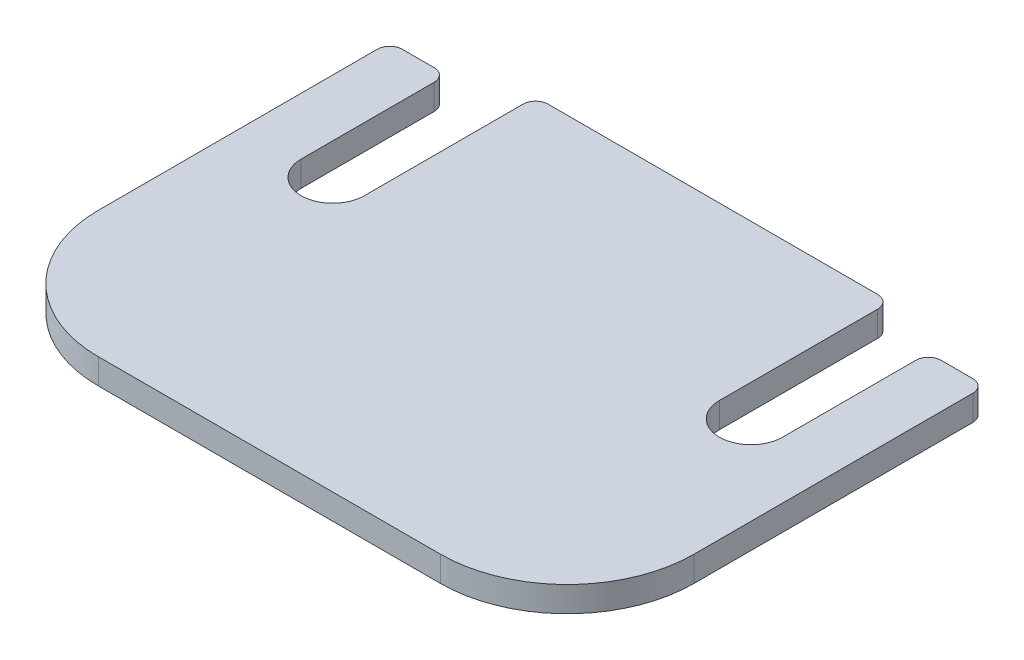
ISO-10303-21;
HEADER;
FILE_DESCRIPTION(('STEP AP214'),'2;1');
FILE_NAME('part.step','',(''),(''),'','','');
FILE_SCHEMA(('AUTOMOTIVE_DESIGN { 1 0 10303 214 1 1 1 1 }'));
ENDSEC;
DATA;
#1=APPLICATION_CONTEXT('core data for automotive mechanical design processes');
#2=APPLICATION_PROTOCOL_DEFINITION('international standard','automotive_design',2000,#1);
#3=PRODUCT_CONTEXT('',#1,'mechanical');
#4=PRODUCT('Part','Part','',(#3));
#5=PRODUCT_RELATED_PRODUCT_CATEGORY('part','',(#4));
#6=PRODUCT_DEFINITION_FORMATION('','',#4);
#7=PRODUCT_DEFINITION_CONTEXT('part definition',#1,'design');
#8=PRODUCT_DEFINITION('design','',#6,#7);
#9=PRODUCT_DEFINITION_SHAPE('','',#8);
#10=(LENGTH_UNIT() NAMED_UNIT(*) SI_UNIT(.MILLI.,.METRE.));
#11=(NAMED_UNIT(*) PLANE_ANGLE_UNIT() SI_UNIT($,.RADIAN.));
#12=(NAMED_UNIT(*) SI_UNIT($,.STERADIAN.) SOLID_ANGLE_UNIT());
#13=UNCERTAINTY_MEASURE_WITH_UNIT(LENGTH_MEASURE(1.E-05),#10,'distance_accuracy_value','');
#14=(GEOMETRIC_REPRESENTATION_CONTEXT(3) GLOBAL_UNCERTAINTY_ASSIGNED_CONTEXT((#13)) GLOBAL_UNIT_ASSIGNED_CONTEXT((#10,
#11,#12)) REPRESENTATION_CONTEXT('',''));
#15=CARTESIAN_POINT('',(0.,0.,0.));
#16=DIRECTION('',(0.,0.,1.));
#17=DIRECTION('',(1.,0.,0.));
#18=AXIS2_PLACEMENT_3D('',#15,#16,#17);
#19=CARTESIAN_POINT('',(13.5,2.,7.50000000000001));
#20=DIRECTION('',(0.,-1.,0.));
#21=DIRECTION('',(0.,0.,-1.));
#22=AXIS2_PLACEMENT_3D('',#19,#20,#21);
#23=CYLINDRICAL_SURFACE('',#22,10.);
#24=CARTESIAN_POINT('',(13.5,0.,7.50000000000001));
#25=DIRECTION('',(0.,1.,0.));
#26=DIRECTION('',(0.,0.,1.));
#27=AXIS2_PLACEMENT_3D('',#24,#25,#26);
#28=CIRCLE('',#27,10.);
#29=CARTESIAN_POINT('',(13.4999999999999,0.,17.5));
#30=VERTEX_POINT('',#29);
#31=CARTESIAN_POINT('',(23.5,0.,7.49999999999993));
#32=VERTEX_POINT('',#31);
#33=EDGE_CURVE('E200',#30,#32,#28,.T.);
#34=ORIENTED_EDGE('',*,*,#33,.T.);
#35=DIRECTION('',(0.,-1.,0.));
#36=VECTOR('',#35,1.);
#37=CARTESIAN_POINT('',(23.5,2.,7.49999999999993));
#38=LINE('',#37,#36);
#39=CARTESIAN_POINT('',(23.5,2.,7.49999999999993));
#40=VERTEX_POINT('',#39);
#41=EDGE_CURVE('E11',#40,#32,#38,.T.);
#42=ORIENTED_EDGE('',*,*,#41,.F.);
#43=CARTESIAN_POINT('',(13.5,2.,7.50000000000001));
#44=DIRECTION('',(0.,1.,0.));
#45=DIRECTION('',(0.,0.,1.));
#46=AXIS2_PLACEMENT_3D('',#43,#44,#45);
#47=CIRCLE('',#46,10.);
#48=CARTESIAN_POINT('',(13.4999999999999,2.,17.5));
#49=VERTEX_POINT('',#48);
#50=EDGE_CURVE('E238',#49,#40,#47,.T.);
#51=ORIENTED_EDGE('',*,*,#50,.F.);
#52=DIRECTION('',(0.,-1.,0.));
#53=VECTOR('',#52,1.);
#54=CARTESIAN_POINT('',(13.4999999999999,2.,17.5));
#55=LINE('',#54,#53);
#56=EDGE_CURVE('E196',#49,#30,#55,.T.);
#57=ORIENTED_EDGE('',*,*,#56,.T.);
#58=EDGE_LOOP('',(#34,#42,#51,#57));
#59=FACE_BOUND('',#58,.T.);
#60=ADVANCED_FACE('F32',(#59),#23,.T.);
#61=CARTESIAN_POINT('',(23.5,2.,-14.5));
#62=DIRECTION('',(-1.,0.,0.));
#63=DIRECTION('',(0.,0.,1.));
#64=AXIS2_PLACEMENT_3D('',#61,#62,#63);
#65=PLANE('',#64);
#66=DIRECTION('',(0.,0.,-1.));
#67=VECTOR('',#66,1.);
#68=CARTESIAN_POINT('',(23.5,0.,-14.5));
#69=LINE('',#68,#67);
#70=CARTESIAN_POINT('',(23.5,0.,-14.5));
#71=VERTEX_POINT('',#70);
#72=EDGE_CURVE('E203',#32,#71,#69,.T.);
#73=ORIENTED_EDGE('',*,*,#72,.T.);
#74=DIRECTION('',(0.,-1.,0.));
#75=VECTOR('',#74,1.);
#76=CARTESIAN_POINT('',(23.5,2.,-14.5));
#77=LINE('',#76,#75);
#78=CARTESIAN_POINT('',(23.5,2.,-14.5));
#79=VERTEX_POINT('',#78);
#80=EDGE_CURVE('E40',#79,#71,#77,.T.);
#81=ORIENTED_EDGE('',*,*,#80,.F.);
#82=DIRECTION('',(0.,0.,-1.));
#83=VECTOR('',#82,1.);
#84=CARTESIAN_POINT('',(23.5,2.,-14.5));
#85=LINE('',#84,#83);
#86=EDGE_CURVE('E127',#40,#79,#85,.T.);
#87=ORIENTED_EDGE('',*,*,#86,.F.);
#88=ORIENTED_EDGE('',*,*,#41,.T.);
#89=EDGE_LOOP('',(#73,#81,#87,#88));
#90=FACE_BOUND('',#89,.T.);
#91=ADVANCED_FACE('F356',(#90),#65,.F.);
#92=CARTESIAN_POINT('',(22.5,2.,-14.5));
#93=DIRECTION('',(0.,-1.,0.));
#94=DIRECTION('',(0.,0.,-1.));
#95=AXIS2_PLACEMENT_3D('',#92,#93,#94);
#96=CYLINDRICAL_SURFACE('',#95,1.);
#97=CARTESIAN_POINT('',(22.5,0.,-14.5));
#98=DIRECTION('',(0.,1.,0.));
#99=DIRECTION('',(0.,0.,-1.));
#100=AXIS2_PLACEMENT_3D('',#97,#98,#99);
#101=CIRCLE('',#100,1.);
#102=CARTESIAN_POINT('',(22.5,0.,-15.5));
#103=VERTEX_POINT('',#102);
#104=EDGE_CURVE('E205',#71,#103,#101,.T.);
#105=ORIENTED_EDGE('',*,*,#104,.T.);
#106=DIRECTION('',(0.,-1.,0.));
#107=VECTOR('',#106,1.);
#108=CARTESIAN_POINT('',(22.5,2.,-15.5));
#109=LINE('',#108,#107);
#110=CARTESIAN_POINT('',(22.5,2.,-15.5));
#111=VERTEX_POINT('',#110);
#112=EDGE_CURVE('E281',#111,#103,#109,.T.);
#113=ORIENTED_EDGE('',*,*,#112,.F.);
#114=CARTESIAN_POINT('',(22.5,2.,-14.5));
#115=DIRECTION('',(0.,1.,0.));
#116=DIRECTION('',(0.,0.,-1.));
#117=AXIS2_PLACEMENT_3D('',#114,#115,#116);
#118=CIRCLE('',#117,1.);
#119=EDGE_CURVE('E289',#79,#111,#118,.T.);
#120=ORIENTED_EDGE('',*,*,#119,.F.);
#121=ORIENTED_EDGE('',*,*,#80,.T.);
#122=EDGE_LOOP('',(#105,#113,#120,#121));
#123=FACE_BOUND('',#122,.T.);
#124=ADVANCED_FACE('F287',(#123),#96,.T.);
#125=CARTESIAN_POINT('',(20.,2.,-15.5));
#126=DIRECTION('',(0.,0.,1.));
#127=DIRECTION('',(1.,0.,0.));
#128=AXIS2_PLACEMENT_3D('',#125,#126,#127);
#129=PLANE('',#128);
#130=DIRECTION('',(-1.,0.,0.));
#131=VECTOR('',#130,1.);
#132=CARTESIAN_POINT('',(20.,0.,-15.5));
#133=LINE('',#132,#131);
#134=CARTESIAN_POINT('',(20.,0.,-15.5));
#135=VERTEX_POINT('',#134);
#136=EDGE_CURVE('E207',#103,#135,#133,.T.);
#137=ORIENTED_EDGE('',*,*,#136,.T.);
#138=DIRECTION('',(0.,-1.,0.));
#139=VECTOR('',#138,1.);
#140=CARTESIAN_POINT('',(20.,2.,-15.5));
#141=LINE('',#140,#139);
#142=CARTESIAN_POINT('',(20.,2.,-15.5));
#143=VERTEX_POINT('',#142);
#144=EDGE_CURVE('E278',#143,#135,#141,.T.);
#145=ORIENTED_EDGE('',*,*,#144,.F.);
#146=DIRECTION('',(-1.,0.,0.));
#147=VECTOR('',#146,1.);
#148=CARTESIAN_POINT('',(20.,2.,-15.5));
#149=LINE('',#148,#147);
#150=EDGE_CURVE('E307',#111,#143,#149,.T.);
#151=ORIENTED_EDGE('',*,*,#150,.F.);
#152=ORIENTED_EDGE('',*,*,#112,.T.);
#153=EDGE_LOOP('',(#137,#145,#151,#152));
#154=FACE_BOUND('',#153,.T.);
#155=ADVANCED_FACE('F298',(#154),#129,.F.);
#156=CARTESIAN_POINT('',(20.,2.,-14.5));
#157=DIRECTION('',(0.,-1.,0.));
#158=DIRECTION('',(0.,0.,-1.));
#159=AXIS2_PLACEMENT_3D('',#156,#157,#158);
#160=CYLINDRICAL_SURFACE('',#159,1.);
#161=CARTESIAN_POINT('',(20.,0.,-14.5));
#162=DIRECTION('',(0.,1.,0.));
#163=DIRECTION('',(0.,0.,1.));
#164=AXIS2_PLACEMENT_3D('',#161,#162,#163);
#165=CIRCLE('',#164,1.);
#166=CARTESIAN_POINT('',(19.,0.,-14.5));
#167=VERTEX_POINT('',#166);
#168=EDGE_CURVE('E209',#135,#167,#165,.T.);
#169=ORIENTED_EDGE('',*,*,#168,.T.);
#170=DIRECTION('',(0.,-1.,0.));
#171=VECTOR('',#170,1.);
#172=CARTESIAN_POINT('',(19.,2.,-14.5));
#173=LINE('',#172,#171);
#174=CARTESIAN_POINT('',(19.,2.,-14.5));
#175=VERTEX_POINT('',#174);
#176=EDGE_CURVE('E275',#175,#167,#173,.T.);
#177=ORIENTED_EDGE('',*,*,#176,.F.);
#178=CARTESIAN_POINT('',(20.,2.,-14.5));
#179=DIRECTION('',(0.,1.,0.));
#180=DIRECTION('',(0.,0.,1.));
#181=AXIS2_PLACEMENT_3D('',#178,#179,#180);
#182=CIRCLE('',#181,1.);
#183=EDGE_CURVE('E304',#143,#175,#182,.T.);
#184=ORIENTED_EDGE('',*,*,#183,.F.);
#185=ORIENTED_EDGE('',*,*,#144,.T.);
#186=EDGE_LOOP('',(#169,#177,#184,#185));
#187=FACE_BOUND('',#186,.T.);
#188=ADVANCED_FACE('F302',(#187),#160,.T.);
#189=CARTESIAN_POINT('',(19.,2.,-14.5));
#190=DIRECTION('',(1.,0.,0.));
#191=DIRECTION('',(0.,0.,-1.));
#192=AXIS2_PLACEMENT_3D('',#189,#190,#191);
#193=PLANE('',#192);
#194=DIRECTION('',(0.,0.,1.));
#195=VECTOR('',#194,1.);
#196=CARTESIAN_POINT('',(19.,0.,-14.5));
#197=LINE('',#196,#195);
#198=CARTESIAN_POINT('',(19.,0.,-4.));
#199=VERTEX_POINT('',#198);
#200=EDGE_CURVE('E211',#167,#199,#197,.T.);
#201=ORIENTED_EDGE('',*,*,#200,.T.);
#202=DIRECTION('',(0.,-1.,0.));
#203=VECTOR('',#202,1.);
#204=CARTESIAN_POINT('',(19.,2.,-4.));
#205=LINE('',#204,#203);
#206=CARTESIAN_POINT('',(19.,2.,-4.));
#207=VERTEX_POINT('',#206);
#208=EDGE_CURVE('E272',#207,#199,#205,.T.);
#209=ORIENTED_EDGE('',*,*,#208,.F.);
#210=DIRECTION('',(0.,0.,1.));
#211=VECTOR('',#210,1.);
#212=CARTESIAN_POINT('',(19.,2.,-14.5));
#213=LINE('',#212,#211);
#214=EDGE_CURVE('E306',#175,#207,#213,.T.);
#215=ORIENTED_EDGE('',*,*,#214,.F.);
#216=ORIENTED_EDGE('',*,*,#176,.T.);
#217=EDGE_LOOP('',(#201,#209,#215,#216));
#218=FACE_BOUND('',#217,.T.);
#219=ADVANCED_FACE('F369',(#218),#193,.F.);
#220=CARTESIAN_POINT('',(16.5,2.,-4.));
#221=DIRECTION('',(0.,-1.,0.));
#222=DIRECTION('',(0.,0.,-1.));
#223=AXIS2_PLACEMENT_3D('',#220,#221,#222);
#224=CYLINDRICAL_SURFACE('',#223,2.50000000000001);
#225=CARTESIAN_POINT('',(16.5,0.,-4.));
#226=DIRECTION('',(0.,-1.,0.));
#227=DIRECTION('',(0.,0.,1.));
#228=AXIS2_PLACEMENT_3D('',#225,#226,#227);
#229=CIRCLE('',#228,2.50000000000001);
#230=CARTESIAN_POINT('',(14.,0.,-4.));
#231=VERTEX_POINT('',#230);
#232=EDGE_CURVE('E213',#199,#231,#229,.T.);
#233=ORIENTED_EDGE('',*,*,#232,.T.);
#234=DIRECTION('',(0.,-1.,0.));
#235=VECTOR('',#234,1.);
#236=CARTESIAN_POINT('',(14.,2.,-4.));
#237=LINE('',#236,#235);
#238=CARTESIAN_POINT('',(14.,2.,-4.));
#239=VERTEX_POINT('',#238);
#240=EDGE_CURVE('E269',#239,#231,#237,.T.);
#241=ORIENTED_EDGE('',*,*,#240,.F.);
#242=CARTESIAN_POINT('',(16.5,2.,-4.));
#243=DIRECTION('',(0.,-1.,0.));
#244=DIRECTION('',(0.,0.,1.));
#245=AXIS2_PLACEMENT_3D('',#242,#243,#244);
#246=CIRCLE('',#245,2.50000000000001);
#247=EDGE_CURVE('E309',#207,#239,#246,.T.);
#248=ORIENTED_EDGE('',*,*,#247,.F.);
#249=ORIENTED_EDGE('',*,*,#208,.T.);
#250=EDGE_LOOP('',(#233,#241,#248,#249));
#251=FACE_BOUND('',#250,.T.);
#252=ADVANCED_FACE('F372',(#251),#224,.F.);
#253=CARTESIAN_POINT('',(14.,2.,-16.5));
#254=DIRECTION('',(-1.,0.,0.));
#255=DIRECTION('',(0.,0.,1.));
#256=AXIS2_PLACEMENT_3D('',#253,#254,#255);
#257=PLANE('',#256);
#258=DIRECTION('',(0.,0.,-1.));
#259=VECTOR('',#258,1.);
#260=CARTESIAN_POINT('',(14.,0.,-16.5));
#261=LINE('',#260,#259);
#262=CARTESIAN_POINT('',(14.,0.,-16.5));
#263=VERTEX_POINT('',#262);
#264=EDGE_CURVE('E215',#231,#263,#261,.T.);
#265=ORIENTED_EDGE('',*,*,#264,.T.);
#266=DIRECTION('',(0.,-1.,0.));
#267=VECTOR('',#266,1.);
#268=CARTESIAN_POINT('',(14.,2.,-16.5));
#269=LINE('',#268,#267);
#270=CARTESIAN_POINT('',(14.,2.,-16.5));
#271=VERTEX_POINT('',#270);
#272=EDGE_CURVE('E266',#271,#263,#269,.T.);
#273=ORIENTED_EDGE('',*,*,#272,.F.);
#274=DIRECTION('',(0.,0.,-1.));
#275=VECTOR('',#274,1.);
#276=CARTESIAN_POINT('',(14.,2.,-16.5));
#277=LINE('',#276,#275);
#278=EDGE_CURVE('E315',#239,#271,#277,.T.);
#279=ORIENTED_EDGE('',*,*,#278,.F.);
#280=ORIENTED_EDGE('',*,*,#240,.T.);
#281=EDGE_LOOP('',(#265,#273,#279,#280));
#282=FACE_BOUND('',#281,.T.);
#283=ADVANCED_FACE('F376',(#282),#257,.F.);
#284=CARTESIAN_POINT('',(13.,2.,-16.5));
#285=DIRECTION('',(0.,-1.,0.));
#286=DIRECTION('',(0.,0.,-1.));
#287=AXIS2_PLACEMENT_3D('',#284,#285,#286);
#288=CYLINDRICAL_SURFACE('',#287,1.);
#289=CARTESIAN_POINT('',(13.,0.,-16.5));
#290=DIRECTION('',(0.,1.,0.));
#291=DIRECTION('',(0.,0.,1.));
#292=AXIS2_PLACEMENT_3D('',#289,#290,#291);
#293=CIRCLE('',#292,1.);
#294=CARTESIAN_POINT('',(13.,0.,-17.5));
#295=VERTEX_POINT('',#294);
#296=EDGE_CURVE('E217',#263,#295,#293,.T.);
#297=ORIENTED_EDGE('',*,*,#296,.T.);
#298=DIRECTION('',(0.,-1.,0.));
#299=VECTOR('',#298,1.);
#300=CARTESIAN_POINT('',(13.,2.,-17.5));
#301=LINE('',#300,#299);
#302=CARTESIAN_POINT('',(13.,2.,-17.5));
#303=VERTEX_POINT('',#302);
#304=EDGE_CURVE('E263',#303,#295,#301,.T.);
#305=ORIENTED_EDGE('',*,*,#304,.F.);
#306=CARTESIAN_POINT('',(13.,2.,-16.5));
#307=DIRECTION('',(0.,1.,0.));
#308=DIRECTION('',(0.,0.,1.));
#309=AXIS2_PLACEMENT_3D('',#306,#307,#308);
#310=CIRCLE('',#309,1.);
#311=EDGE_CURVE('E317',#271,#303,#310,.T.);
#312=ORIENTED_EDGE('',*,*,#311,.F.);
#313=ORIENTED_EDGE('',*,*,#272,.T.);
#314=EDGE_LOOP('',(#297,#305,#312,#313));
#315=FACE_BOUND('',#314,.T.);
#316=ADVANCED_FACE('F380',(#315),#288,.T.);
#317=CARTESIAN_POINT('',(-13.,2.,-17.5));
#318=DIRECTION('',(0.,0.,1.));
#319=DIRECTION('',(1.,0.,0.));
#320=AXIS2_PLACEMENT_3D('',#317,#318,#319);
#321=PLANE('',#320);
#322=DIRECTION('',(-1.,0.,0.));
#323=VECTOR('',#322,1.);
#324=CARTESIAN_POINT('',(-13.,0.,-17.5));
#325=LINE('',#324,#323);
#326=CARTESIAN_POINT('',(-13.,0.,-17.5));
#327=VERTEX_POINT('',#326);
#328=EDGE_CURVE('E219',#295,#327,#325,.T.);
#329=ORIENTED_EDGE('',*,*,#328,.T.);
#330=DIRECTION('',(0.,-1.,0.));
#331=VECTOR('',#330,1.);
#332=CARTESIAN_POINT('',(-13.,2.,-17.5));
#333=LINE('',#332,#331);
#334=CARTESIAN_POINT('',(-13.,2.,-17.5));
#335=VERTEX_POINT('',#334);
#336=EDGE_CURVE('E260',#335,#327,#333,.T.);
#337=ORIENTED_EDGE('',*,*,#336,.F.);
#338=DIRECTION('',(-1.,0.,0.));
#339=VECTOR('',#338,1.);
#340=CARTESIAN_POINT('',(-13.,2.,-17.5));
#341=LINE('',#340,#339);
#342=EDGE_CURVE('E319',#303,#335,#341,.T.);
#343=ORIENTED_EDGE('',*,*,#342,.F.);
#344=ORIENTED_EDGE('',*,*,#304,.T.);
#345=EDGE_LOOP('',(#329,#337,#343,#344));
#346=FACE_BOUND('',#345,.T.);
#347=ADVANCED_FACE('F384',(#346),#321,.F.);
#348=CARTESIAN_POINT('',(-13.,2.,-16.5));
#349=DIRECTION('',(0.,-1.,0.));
#350=DIRECTION('',(0.,0.,-1.));
#351=AXIS2_PLACEMENT_3D('',#348,#349,#350);
#352=CYLINDRICAL_SURFACE('',#351,1.);
#353=CARTESIAN_POINT('',(-13.,0.,-16.5));
#354=DIRECTION('',(0.,1.,0.));
#355=DIRECTION('',(0.,0.,-1.));
#356=AXIS2_PLACEMENT_3D('',#353,#354,#355);
#357=CIRCLE('',#356,1.);
#358=CARTESIAN_POINT('',(-14.,0.,-16.5));
#359=VERTEX_POINT('',#358);
#360=EDGE_CURVE('E221',#327,#359,#357,.T.);
#361=ORIENTED_EDGE('',*,*,#360,.T.);
#362=DIRECTION('',(0.,-1.,0.));
#363=VECTOR('',#362,1.);
#364=CARTESIAN_POINT('',(-14.,2.,-16.5));
#365=LINE('',#364,#363);
#366=CARTESIAN_POINT('',(-14.,2.,-16.5));
#367=VERTEX_POINT('',#366);
#368=EDGE_CURVE('E257',#367,#359,#365,.T.);
#369=ORIENTED_EDGE('',*,*,#368,.F.);
#370=CARTESIAN_POINT('',(-13.,2.,-16.5));
#371=DIRECTION('',(0.,1.,0.));
#372=DIRECTION('',(0.,0.,-1.));
#373=AXIS2_PLACEMENT_3D('',#370,#371,#372);
#374=CIRCLE('',#373,1.);
#375=EDGE_CURVE('E321',#335,#367,#374,.T.);
#376=ORIENTED_EDGE('',*,*,#375,.F.);
#377=ORIENTED_EDGE('',*,*,#336,.T.);
#378=EDGE_LOOP('',(#361,#369,#376,#377));
#379=FACE_BOUND('',#378,.T.);
#380=ADVANCED_FACE('F388',(#379),#352,.T.);
#381=CARTESIAN_POINT('',(-14.,2.,-16.5));
#382=DIRECTION('',(1.,0.,0.));
#383=DIRECTION('',(0.,0.,-1.));
#384=AXIS2_PLACEMENT_3D('',#381,#382,#383);
#385=PLANE('',#384);
#386=DIRECTION('',(0.,0.,1.));
#387=VECTOR('',#386,1.);
#388=CARTESIAN_POINT('',(-14.,0.,-16.5));
#389=LINE('',#388,#387);
#390=CARTESIAN_POINT('',(-14.,0.,-3.99999999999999));
#391=VERTEX_POINT('',#390);
#392=EDGE_CURVE('E223',#359,#391,#389,.T.);
#393=ORIENTED_EDGE('',*,*,#392,.T.);
#394=DIRECTION('',(0.,-1.,0.));
#395=VECTOR('',#394,1.);
#396=CARTESIAN_POINT('',(-14.,2.,-3.99999999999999));
#397=LINE('',#396,#395);
#398=CARTESIAN_POINT('',(-14.,2.,-3.99999999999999));
#399=VERTEX_POINT('',#398);
#400=EDGE_CURVE('E254',#399,#391,#397,.T.);
#401=ORIENTED_EDGE('',*,*,#400,.F.);
#402=DIRECTION('',(0.,0.,1.));
#403=VECTOR('',#402,1.);
#404=CARTESIAN_POINT('',(-14.,2.,-16.5));
#405=LINE('',#404,#403);
#406=EDGE_CURVE('E323',#367,#399,#405,.T.);
#407=ORIENTED_EDGE('',*,*,#406,.F.);
#408=ORIENTED_EDGE('',*,*,#368,.T.);
#409=EDGE_LOOP('',(#393,#401,#407,#408));
#410=FACE_BOUND('',#409,.T.);
#411=ADVANCED_FACE('F392',(#410),#385,.F.);
#412=CARTESIAN_POINT('',(-16.5,2.,-3.99999999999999));
#413=DIRECTION('',(0.,-1.,0.));
#414=DIRECTION('',(0.,0.,-1.));
#415=AXIS2_PLACEMENT_3D('',#412,#413,#414);
#416=CYLINDRICAL_SURFACE('',#415,2.5);
#417=CARTESIAN_POINT('',(-16.5,0.,-3.99999999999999));
#418=DIRECTION('',(0.,-1.,0.));
#419=DIRECTION('',(0.,0.,1.));
#420=AXIS2_PLACEMENT_3D('',#417,#418,#419);
#421=CIRCLE('',#420,2.5);
#422=CARTESIAN_POINT('',(-19.,0.,-3.99999999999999));
#423=VERTEX_POINT('',#422);
#424=EDGE_CURVE('E225',#391,#423,#421,.T.);
#425=ORIENTED_EDGE('',*,*,#424,.T.);
#426=DIRECTION('',(0.,-1.,0.));
#427=VECTOR('',#426,1.);
#428=CARTESIAN_POINT('',(-19.,2.,-3.99999999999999));
#429=LINE('',#428,#427);
#430=CARTESIAN_POINT('',(-19.,2.,-3.99999999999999));
#431=VERTEX_POINT('',#430);
#432=EDGE_CURVE('E251',#431,#423,#429,.T.);
#433=ORIENTED_EDGE('',*,*,#432,.F.);
#434=CARTESIAN_POINT('',(-16.5,2.,-3.99999999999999));
#435=DIRECTION('',(0.,-1.,0.));
#436=DIRECTION('',(0.,0.,1.));
#437=AXIS2_PLACEMENT_3D('',#434,#435,#436);
#438=CIRCLE('',#437,2.5);
#439=EDGE_CURVE('E325',#399,#431,#438,.T.);
#440=ORIENTED_EDGE('',*,*,#439,.F.);
#441=ORIENTED_EDGE('',*,*,#400,.T.);
#442=EDGE_LOOP('',(#425,#433,#440,#441));
#443=FACE_BOUND('',#442,.T.);
#444=ADVANCED_FACE('F396',(#443),#416,.F.);
#445=CARTESIAN_POINT('',(-19.,2.,-14.5));
#446=DIRECTION('',(-1.,0.,0.));
#447=DIRECTION('',(0.,0.,1.));
#448=AXIS2_PLACEMENT_3D('',#445,#446,#447);
#449=PLANE('',#448);
#450=DIRECTION('',(0.,0.,-1.));
#451=VECTOR('',#450,1.);
#452=CARTESIAN_POINT('',(-19.,0.,-14.5));
#453=LINE('',#452,#451);
#454=CARTESIAN_POINT('',(-19.,0.,-14.5));
#455=VERTEX_POINT('',#454);
#456=EDGE_CURVE('E227',#423,#455,#453,.T.);
#457=ORIENTED_EDGE('',*,*,#456,.T.);
#458=DIRECTION('',(0.,-1.,0.));
#459=VECTOR('',#458,1.);
#460=CARTESIAN_POINT('',(-19.,2.,-14.5));
#461=LINE('',#460,#459);
#462=CARTESIAN_POINT('',(-19.,2.,-14.5));
#463=VERTEX_POINT('',#462);
#464=EDGE_CURVE('E248',#463,#455,#461,.T.);
#465=ORIENTED_EDGE('',*,*,#464,.F.);
#466=DIRECTION('',(0.,0.,-1.));
#467=VECTOR('',#466,1.);
#468=CARTESIAN_POINT('',(-19.,2.,-14.5));
#469=LINE('',#468,#467);
#470=EDGE_CURVE('E327',#431,#463,#469,.T.);
#471=ORIENTED_EDGE('',*,*,#470,.F.);
#472=ORIENTED_EDGE('',*,*,#432,.T.);
#473=EDGE_LOOP('',(#457,#465,#471,#472));
#474=FACE_BOUND('',#473,.T.);
#475=ADVANCED_FACE('F400',(#474),#449,.F.);
#476=CARTESIAN_POINT('',(-20.,2.,-14.5));
#477=DIRECTION('',(0.,-1.,0.));
#478=DIRECTION('',(0.,0.,-1.));
#479=AXIS2_PLACEMENT_3D('',#476,#477,#478);
#480=CYLINDRICAL_SURFACE('',#479,1.);
#481=CARTESIAN_POINT('',(-20.,0.,-14.5));
#482=DIRECTION('',(0.,1.,0.));
#483=DIRECTION('',(0.,0.,-1.));
#484=AXIS2_PLACEMENT_3D('',#481,#482,#483);
#485=CIRCLE('',#484,1.);
#486=CARTESIAN_POINT('',(-20.,0.,-15.5));
#487=VERTEX_POINT('',#486);
#488=EDGE_CURVE('E229',#455,#487,#485,.T.);
#489=ORIENTED_EDGE('',*,*,#488,.T.);
#490=DIRECTION('',(0.,-1.,0.));
#491=VECTOR('',#490,1.);
#492=CARTESIAN_POINT('',(-20.,2.,-15.5));
#493=LINE('',#492,#491);
#494=CARTESIAN_POINT('',(-20.,2.,-15.5));
#495=VERTEX_POINT('',#494);
#496=EDGE_CURVE('E245',#495,#487,#493,.T.);
#497=ORIENTED_EDGE('',*,*,#496,.F.);
#498=CARTESIAN_POINT('',(-20.,2.,-14.5));
#499=DIRECTION('',(0.,1.,0.));
#500=DIRECTION('',(0.,0.,-1.));
#501=AXIS2_PLACEMENT_3D('',#498,#499,#500);
#502=CIRCLE('',#501,1.);
#503=EDGE_CURVE('E329',#463,#495,#502,.T.);
#504=ORIENTED_EDGE('',*,*,#503,.F.);
#505=ORIENTED_EDGE('',*,*,#464,.T.);
#506=EDGE_LOOP('',(#489,#497,#504,#505));
#507=FACE_BOUND('',#506,.T.);
#508=ADVANCED_FACE('F404',(#507),#480,.T.);
#509=CARTESIAN_POINT('',(-20.,2.,-15.5));
#510=DIRECTION('',(0.,0.,1.));
#511=DIRECTION('',(1.,0.,0.));
#512=AXIS2_PLACEMENT_3D('',#509,#510,#511);
#513=PLANE('',#512);
#514=DIRECTION('',(-1.,0.,0.));
#515=VECTOR('',#514,1.);
#516=CARTESIAN_POINT('',(-20.,0.,-15.5));
#517=LINE('',#516,#515);
#518=CARTESIAN_POINT('',(-22.5,0.,-15.5));
#519=VERTEX_POINT('',#518);
#520=EDGE_CURVE('E231',#487,#519,#517,.T.);
#521=ORIENTED_EDGE('',*,*,#520,.T.);
#522=DIRECTION('',(0.,-1.,0.));
#523=VECTOR('',#522,1.);
#524=CARTESIAN_POINT('',(-22.5,2.,-15.5));
#525=LINE('',#524,#523);
#526=CARTESIAN_POINT('',(-22.5,2.,-15.5));
#527=VERTEX_POINT('',#526);
#528=EDGE_CURVE('E242',#527,#519,#525,.T.);
#529=ORIENTED_EDGE('',*,*,#528,.F.);
#530=DIRECTION('',(-1.,0.,0.));
#531=VECTOR('',#530,1.);
#532=CARTESIAN_POINT('',(-20.,2.,-15.5));
#533=LINE('',#532,#531);
#534=EDGE_CURVE('E331',#495,#527,#533,.T.);
#535=ORIENTED_EDGE('',*,*,#534,.F.);
#536=ORIENTED_EDGE('',*,*,#496,.T.);
#537=EDGE_LOOP('',(#521,#529,#535,#536));
#538=FACE_BOUND('',#537,.T.);
#539=ADVANCED_FACE('F337',(#538),#513,.F.);
#540=CARTESIAN_POINT('',(-22.5,2.,-14.5));
#541=DIRECTION('',(0.,-1.,0.));
#542=DIRECTION('',(0.,0.,-1.));
#543=AXIS2_PLACEMENT_3D('',#540,#541,#542);
#544=CYLINDRICAL_SURFACE('',#543,1.);
#545=CARTESIAN_POINT('',(-22.5,0.,-14.5));
#546=DIRECTION('',(0.,1.,0.));
#547=DIRECTION('',(0.,0.,1.));
#548=AXIS2_PLACEMENT_3D('',#545,#546,#547);
#549=CIRCLE('',#548,1.);
#550=CARTESIAN_POINT('',(-23.5,0.,-14.5));
#551=VERTEX_POINT('',#550);
#552=EDGE_CURVE('E233',#519,#551,#549,.T.);
#553=ORIENTED_EDGE('',*,*,#552,.T.);
#554=DIRECTION('',(0.,-1.,0.));
#555=VECTOR('',#554,1.);
#556=CARTESIAN_POINT('',(-23.5,2.,-14.5));
#557=LINE('',#556,#555);
#558=CARTESIAN_POINT('',(-23.5,2.,-14.5));
#559=VERTEX_POINT('',#558);
#560=EDGE_CURVE('E191',#559,#551,#557,.T.);
#561=ORIENTED_EDGE('',*,*,#560,.F.);
#562=CARTESIAN_POINT('',(-22.5,2.,-14.5));
#563=DIRECTION('',(0.,1.,0.));
#564=DIRECTION('',(0.,0.,1.));
#565=AXIS2_PLACEMENT_3D('',#562,#563,#564);
#566=CIRCLE('',#565,1.);
#567=EDGE_CURVE('E182',#527,#559,#566,.T.);
#568=ORIENTED_EDGE('',*,*,#567,.F.);
#569=ORIENTED_EDGE('',*,*,#528,.T.);
#570=EDGE_LOOP('',(#553,#561,#568,#569));
#571=FACE_BOUND('',#570,.T.);
#572=ADVANCED_FACE('F341',(#571),#544,.T.);
#573=CARTESIAN_POINT('',(-23.5,2.,-14.5));
#574=DIRECTION('',(1.,0.,0.));
#575=DIRECTION('',(0.,0.,-1.));
#576=AXIS2_PLACEMENT_3D('',#573,#574,#575);
#577=PLANE('',#576);
#578=DIRECTION('',(0.,0.,1.));
#579=VECTOR('',#578,1.);
#580=CARTESIAN_POINT('',(-23.5,0.,-14.5));
#581=LINE('',#580,#579);
#582=CARTESIAN_POINT('',(-23.5,0.,7.49999999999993));
#583=VERTEX_POINT('',#582);
#584=EDGE_CURVE('E190',#551,#583,#581,.T.);
#585=ORIENTED_EDGE('',*,*,#584,.T.);
#586=DIRECTION('',(0.,-1.,0.));
#587=VECTOR('',#586,1.);
#588=CARTESIAN_POINT('',(-23.5,2.,7.49999999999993));
#589=LINE('',#588,#587);
#590=CARTESIAN_POINT('',(-23.5,2.,7.49999999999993));
#591=VERTEX_POINT('',#590);
#592=EDGE_CURVE('E187',#591,#583,#589,.T.);
#593=ORIENTED_EDGE('',*,*,#592,.F.);
#594=DIRECTION('',(0.,0.,1.));
#595=VECTOR('',#594,1.);
#596=CARTESIAN_POINT('',(-23.5,2.,-14.5));
#597=LINE('',#596,#595);
#598=EDGE_CURVE('E176',#559,#591,#597,.T.);
#599=ORIENTED_EDGE('',*,*,#598,.F.);
#600=ORIENTED_EDGE('',*,*,#560,.T.);
#601=EDGE_LOOP('',(#585,#593,#599,#600));
#602=FACE_BOUND('',#601,.T.);
#603=ADVANCED_FACE('F188',(#602),#577,.F.);
#604=CARTESIAN_POINT('',(-13.5,2.,7.50000000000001));
#605=DIRECTION('',(0.,-1.,0.));
#606=DIRECTION('',(0.,0.,-1.));
#607=AXIS2_PLACEMENT_3D('',#604,#605,#606);
#608=CYLINDRICAL_SURFACE('',#607,10.);
#609=CARTESIAN_POINT('',(-13.5,0.,7.50000000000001));
#610=DIRECTION('',(0.,1.,0.));
#611=DIRECTION('',(0.,0.,1.));
#612=AXIS2_PLACEMENT_3D('',#609,#610,#611);
#613=CIRCLE('',#612,10.);
#614=CARTESIAN_POINT('',(-13.4999999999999,0.,17.5));
#615=VERTEX_POINT('',#614);
#616=EDGE_CURVE('E113',#583,#615,#613,.T.);
#617=ORIENTED_EDGE('',*,*,#616,.T.);
#618=DIRECTION('',(0.,-1.,0.));
#619=VECTOR('',#618,1.);
#620=CARTESIAN_POINT('',(-13.4999999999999,2.,17.5));
#621=LINE('',#620,#619);
#622=CARTESIAN_POINT('',(-13.4999999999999,2.,17.5));
#623=VERTEX_POINT('',#622);
#624=EDGE_CURVE('E192',#623,#615,#621,.T.);
#625=ORIENTED_EDGE('',*,*,#624,.F.);
#626=CARTESIAN_POINT('',(-13.5,2.,7.50000000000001));
#627=DIRECTION('',(0.,1.,0.));
#628=DIRECTION('',(0.,0.,1.));
#629=AXIS2_PLACEMENT_3D('',#626,#627,#628);
#630=CIRCLE('',#629,10.);
#631=EDGE_CURVE('E180',#591,#623,#630,.T.);
#632=ORIENTED_EDGE('',*,*,#631,.F.);
#633=ORIENTED_EDGE('',*,*,#592,.T.);
#634=EDGE_LOOP('',(#617,#625,#632,#633));
#635=FACE_BOUND('',#634,.T.);
#636=ADVANCED_FACE('F194',(#635),#608,.T.);
#637=CARTESIAN_POINT('',(-13.4999999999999,2.,17.5));
#638=DIRECTION('',(0.,0.,-1.));
#639=DIRECTION('',(-1.,0.,0.));
#640=AXIS2_PLACEMENT_3D('',#637,#638,#639);
#641=PLANE('',#640);
#642=DIRECTION('',(1.,0.,0.));
#643=VECTOR('',#642,1.);
#644=CARTESIAN_POINT('',(-13.4999999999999,0.,17.5));
#645=LINE('',#644,#643);
#646=EDGE_CURVE('E119',#615,#30,#645,.T.);
#647=ORIENTED_EDGE('',*,*,#646,.T.);
#648=ORIENTED_EDGE('',*,*,#56,.F.);
#649=DIRECTION('',(1.,0.,0.));
#650=VECTOR('',#649,1.);
#651=CARTESIAN_POINT('',(-13.4999999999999,2.,17.5));
#652=LINE('',#651,#650);
#653=EDGE_CURVE('E48',#623,#49,#652,.T.);
#654=ORIENTED_EDGE('',*,*,#653,.F.);
#655=ORIENTED_EDGE('',*,*,#624,.T.);
#656=EDGE_LOOP('',(#647,#648,#654,#655));
#657=FACE_BOUND('',#656,.T.);
#658=ADVANCED_FACE('F345',(#657),#641,.F.);
#659=CARTESIAN_POINT('',(13.5,2.,7.50000000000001));
#660=DIRECTION('',(0.,1.,0.));
#661=DIRECTION('',(0.,0.,1.));
#662=AXIS2_PLACEMENT_3D('',#659,#660,#661);
#663=PLANE('',#662);
#664=ORIENTED_EDGE('',*,*,#50,.T.);
#665=ORIENTED_EDGE('',*,*,#86,.T.);
#666=ORIENTED_EDGE('',*,*,#119,.T.);
#667=ORIENTED_EDGE('',*,*,#150,.T.);
#668=ORIENTED_EDGE('',*,*,#183,.T.);
#669=ORIENTED_EDGE('',*,*,#214,.T.);
#670=ORIENTED_EDGE('',*,*,#247,.T.);
#671=ORIENTED_EDGE('',*,*,#278,.T.);
#672=ORIENTED_EDGE('',*,*,#311,.T.);
#673=ORIENTED_EDGE('',*,*,#342,.T.);
#674=ORIENTED_EDGE('',*,*,#375,.T.);
#675=ORIENTED_EDGE('',*,*,#406,.T.);
#676=ORIENTED_EDGE('',*,*,#439,.T.);
#677=ORIENTED_EDGE('',*,*,#470,.T.);
#678=ORIENTED_EDGE('',*,*,#503,.T.);
#679=ORIENTED_EDGE('',*,*,#534,.T.);
#680=ORIENTED_EDGE('',*,*,#567,.T.);
#681=ORIENTED_EDGE('',*,*,#598,.T.);
#682=ORIENTED_EDGE('',*,*,#631,.T.);
#683=ORIENTED_EDGE('',*,*,#653,.T.);
#684=EDGE_LOOP('',(#664,#665,#666,#667,#668,#669,#670,#671,#672,#673,#674,#675,#676,#677,#678,
#679,#680,#681,#682,#683));
#685=FACE_BOUND('',#684,.T.);
#686=ADVANCED_FACE('F178',(#685),#663,.T.);
#687=CARTESIAN_POINT('',(13.5,0.,7.50000000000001));
#688=DIRECTION('',(0.,1.,0.));
#689=DIRECTION('',(0.,0.,1.));
#690=AXIS2_PLACEMENT_3D('',#687,#688,#689);
#691=PLANE('',#690);
#692=ORIENTED_EDGE('',*,*,#33,.F.);
#693=ORIENTED_EDGE('',*,*,#646,.F.);
#694=ORIENTED_EDGE('',*,*,#616,.F.);
#695=ORIENTED_EDGE('',*,*,#584,.F.);
#696=ORIENTED_EDGE('',*,*,#552,.F.);
#697=ORIENTED_EDGE('',*,*,#520,.F.);
#698=ORIENTED_EDGE('',*,*,#488,.F.);
#699=ORIENTED_EDGE('',*,*,#456,.F.);
#700=ORIENTED_EDGE('',*,*,#424,.F.);
#701=ORIENTED_EDGE('',*,*,#392,.F.);
#702=ORIENTED_EDGE('',*,*,#360,.F.);
#703=ORIENTED_EDGE('',*,*,#328,.F.);
#704=ORIENTED_EDGE('',*,*,#296,.F.);
#705=ORIENTED_EDGE('',*,*,#264,.F.);
#706=ORIENTED_EDGE('',*,*,#232,.F.);
#707=ORIENTED_EDGE('',*,*,#200,.F.);
#708=ORIENTED_EDGE('',*,*,#168,.F.);
#709=ORIENTED_EDGE('',*,*,#136,.F.);
#710=ORIENTED_EDGE('',*,*,#104,.F.);
#711=ORIENTED_EDGE('',*,*,#72,.F.);
#712=EDGE_LOOP('',(#692,#693,#694,#695,#696,#697,#698,#699,#700,#701,#702,#703,#704,#705,#706,
#707,#708,#709,#710,#711));
#713=FACE_BOUND('',#712,.T.);
#714=ADVANCED_FACE('F293',(#713),#691,.F.);
#715=CLOSED_SHELL('',(#60,#91,#124,#155,#188,#219,#252,#283,#316,#347,#380,#411,#444,#475,#508,
#539,#572,#603,#636,#658,#686,#714));
#716=MANIFOLD_SOLID_BREP('B2',#715);
#717=ADVANCED_BREP_SHAPE_REPRESENTATION('',(#18,#716),#14);
#718=SHAPE_DEFINITION_REPRESENTATION(#9,#717);
ENDSEC;
END-ISO-10303-21;
